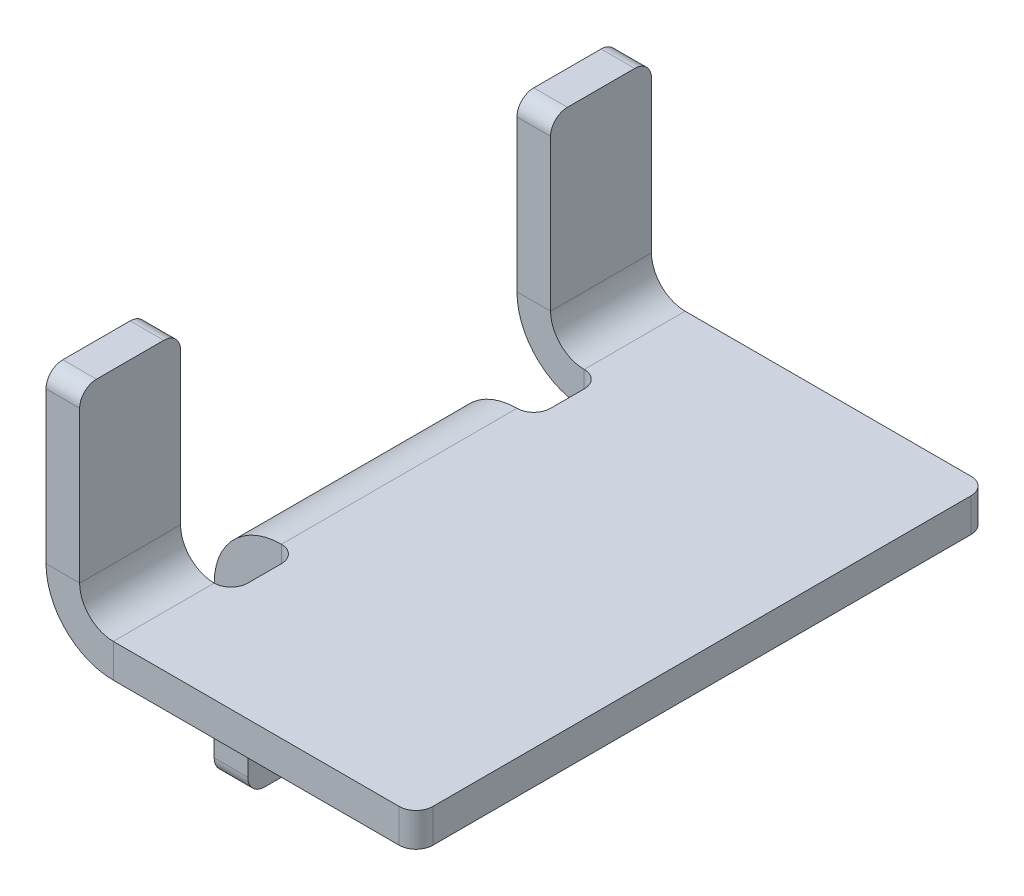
ISO-10303-21;
HEADER;
FILE_DESCRIPTION(('STEP AP214'),'2;1');
FILE_NAME('part.step','',(''),(''),'','','');
FILE_SCHEMA(('AUTOMOTIVE_DESIGN { 1 0 10303 214 1 1 1 1 }'));
ENDSEC;
DATA;
#1=APPLICATION_CONTEXT('core data for automotive mechanical design processes');
#2=APPLICATION_PROTOCOL_DEFINITION('international standard','automotive_design',2000,#1);
#3=PRODUCT_CONTEXT('',#1,'mechanical');
#4=PRODUCT('Part','Part','',(#3));
#5=PRODUCT_RELATED_PRODUCT_CATEGORY('part','',(#4));
#6=PRODUCT_DEFINITION_FORMATION('','',#4);
#7=PRODUCT_DEFINITION_CONTEXT('part definition',#1,'design');
#8=PRODUCT_DEFINITION('design','',#6,#7);
#9=PRODUCT_DEFINITION_SHAPE('','',#8);
#10=(LENGTH_UNIT() NAMED_UNIT(*) SI_UNIT(.MILLI.,.METRE.));
#11=(NAMED_UNIT(*) PLANE_ANGLE_UNIT() SI_UNIT($,.RADIAN.));
#12=(NAMED_UNIT(*) SI_UNIT($,.STERADIAN.) SOLID_ANGLE_UNIT());
#13=UNCERTAINTY_MEASURE_WITH_UNIT(LENGTH_MEASURE(1.E-05),#10,'distance_accuracy_value','');
#14=(GEOMETRIC_REPRESENTATION_CONTEXT(3) GLOBAL_UNCERTAINTY_ASSIGNED_CONTEXT((#13)) GLOBAL_UNIT_ASSIGNED_CONTEXT((#10,
#11,#12)) REPRESENTATION_CONTEXT('',''));
#15=CARTESIAN_POINT('',(0.,0.,0.));
#16=DIRECTION('',(0.,0.,1.));
#17=DIRECTION('',(1.,0.,0.));
#18=AXIS2_PLACEMENT_3D('',#15,#16,#17);
#19=CARTESIAN_POINT('',(1.,0.99999999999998,-8.50000000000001));
#20=DIRECTION('',(0.,0.,-1.));
#21=DIRECTION('',(-1.,0.,0.));
#22=AXIS2_PLACEMENT_3D('',#19,#20,#21);
#23=PLANE('',#22);
#24=DIRECTION('',(-1.,0.,0.));
#25=VECTOR('',#24,1.);
#26=CARTESIAN_POINT('',(0.,1.,-8.50000000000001));
#27=LINE('',#26,#25);
#28=CARTESIAN_POINT('',(0.,1.,-8.50000000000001));
#29=VERTEX_POINT('',#28);
#30=CARTESIAN_POINT('',(-1.,0.999999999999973,-8.50000000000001));
#31=VERTEX_POINT('',#30);
#32=EDGE_CURVE('E903',#29,#31,#27,.T.);
#33=ORIENTED_EDGE('',*,*,#32,.F.);
#34=CARTESIAN_POINT('',(1.,0.99999999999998,-8.50000000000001));
#35=DIRECTION('',(0.,0.,1.));
#36=DIRECTION('',(1.,0.,0.));
#37=AXIS2_PLACEMENT_3D('',#34,#35,#36);
#38=CIRCLE('',#37,1.);
#39=CARTESIAN_POINT('',(1.00000000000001,0.,-8.50000000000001));
#40=VERTEX_POINT('',#39);
#41=EDGE_CURVE('E259',#40,#29,#38,.F.);
#42=ORIENTED_EDGE('',*,*,#41,.F.);
#43=DIRECTION('',(0.,-1.,0.));
#44=VECTOR('',#43,1.);
#45=CARTESIAN_POINT('',(1.00000000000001,0.,-8.50000000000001));
#46=LINE('',#45,#44);
#47=CARTESIAN_POINT('',(0.999999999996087,-1.00000000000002,-8.50000000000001));
#48=VERTEX_POINT('',#47);
#49=EDGE_CURVE('E431',#40,#48,#46,.T.);
#50=ORIENTED_EDGE('',*,*,#49,.T.);
#51=CARTESIAN_POINT('',(1.,0.99999999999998,-8.50000000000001));
#52=DIRECTION('',(0.,0.,1.));
#53=DIRECTION('',(1.,0.,0.));
#54=AXIS2_PLACEMENT_3D('',#51,#52,#53);
#55=CIRCLE('',#54,2.);
#56=EDGE_CURVE('E428',#48,#31,#55,.F.);
#57=ORIENTED_EDGE('',*,*,#56,.T.);
#58=EDGE_LOOP('',(#33,#42,#50,#57));
#59=FACE_BOUND('',#58,.T.);
#60=ADVANCED_FACE('F35',(#59),#23,.T.);
#61=CARTESIAN_POINT('',(1.,0.99999999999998,-5.50000000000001));
#62=DIRECTION('',(0.,0.,-1.));
#63=DIRECTION('',(-1.,0.,0.));
#64=AXIS2_PLACEMENT_3D('',#61,#62,#63);
#65=PLANE('',#64);
#66=CARTESIAN_POINT('',(1.,0.99999999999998,-5.50000000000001));
#67=DIRECTION('',(0.,0.,1.));
#68=DIRECTION('',(1.,0.,0.));
#69=AXIS2_PLACEMENT_3D('',#66,#67,#68);
#70=CIRCLE('',#69,1.);
#71=CARTESIAN_POINT('',(0.,1.,-5.50000000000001));
#72=VERTEX_POINT('',#71);
#73=CARTESIAN_POINT('',(1.00000000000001,0.,-5.50000000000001));
#74=VERTEX_POINT('',#73);
#75=EDGE_CURVE('E265',#72,#74,#70,.T.);
#76=ORIENTED_EDGE('',*,*,#75,.F.);
#77=DIRECTION('',(-1.,0.,0.));
#78=VECTOR('',#77,1.);
#79=CARTESIAN_POINT('',(0.,1.,-5.50000000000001));
#80=LINE('',#79,#78);
#81=CARTESIAN_POINT('',(-1.,0.999999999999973,-5.49999999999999));
#82=VERTEX_POINT('',#81);
#83=EDGE_CURVE('E263',#72,#82,#80,.T.);
#84=ORIENTED_EDGE('',*,*,#83,.T.);
#85=CARTESIAN_POINT('',(1.,0.99999999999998,-5.50000000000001));
#86=DIRECTION('',(0.,0.,1.));
#87=DIRECTION('',(1.,0.,0.));
#88=AXIS2_PLACEMENT_3D('',#85,#86,#87);
#89=CIRCLE('',#88,2.);
#90=CARTESIAN_POINT('',(0.999999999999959,-1.00000000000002,-5.50000000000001));
#91=VERTEX_POINT('',#90);
#92=EDGE_CURVE('E248',#82,#91,#89,.T.);
#93=ORIENTED_EDGE('',*,*,#92,.T.);
#94=DIRECTION('',(0.,-1.,0.));
#95=VECTOR('',#94,1.);
#96=CARTESIAN_POINT('',(1.00000000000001,0.,-5.50000000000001));
#97=LINE('',#96,#95);
#98=EDGE_CURVE('E429',#74,#91,#97,.T.);
#99=ORIENTED_EDGE('',*,*,#98,.F.);
#100=EDGE_LOOP('',(#76,#84,#93,#99));
#101=FACE_BOUND('',#100,.T.);
#102=ADVANCED_FACE('F37',(#101),#65,.F.);
#103=CARTESIAN_POINT('',(1.,0.99999999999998,-5.50000000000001));
#104=DIRECTION('',(0.,0.,1.));
#105=DIRECTION('',(-1.,0.,0.));
#106=AXIS2_PLACEMENT_3D('',#103,#104,#105);
#107=CYLINDRICAL_SURFACE('',#106,2.);
#108=DIRECTION('',(0.,0.,1.));
#109=VECTOR('',#108,1.);
#110=CARTESIAN_POINT('',(0.999999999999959,-1.00000000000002,-5.50000000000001));
#111=LINE('',#110,#109);
#112=EDGE_CURVE('E255',#91,#48,#111,.F.);
#113=ORIENTED_EDGE('',*,*,#112,.F.);
#114=ORIENTED_EDGE('',*,*,#92,.F.);
#115=DIRECTION('',(0.,0.,-1.));
#116=VECTOR('',#115,1.);
#117=CARTESIAN_POINT('',(-1.,0.999999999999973,-5.49999999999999));
#118=LINE('',#117,#116);
#119=EDGE_CURVE('E252',#82,#31,#118,.T.);
#120=ORIENTED_EDGE('',*,*,#119,.T.);
#121=ORIENTED_EDGE('',*,*,#56,.F.);
#122=EDGE_LOOP('',(#113,#114,#120,#121));
#123=FACE_BOUND('',#122,.T.);
#124=ADVANCED_FACE('F250',(#123),#107,.T.);
#125=CARTESIAN_POINT('',(1.,0.99999999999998,-5.50000000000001));
#126=DIRECTION('',(0.,0.,1.));
#127=DIRECTION('',(-1.,0.,0.));
#128=AXIS2_PLACEMENT_3D('',#125,#126,#127);
#129=CYLINDRICAL_SURFACE('',#128,1.);
#130=DIRECTION('',(0.,0.,1.));
#131=VECTOR('',#130,1.);
#132=CARTESIAN_POINT('',(1.00000000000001,0.,-5.50000000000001));
#133=LINE('',#132,#131);
#134=EDGE_CURVE('E424',#74,#40,#133,.F.);
#135=ORIENTED_EDGE('',*,*,#134,.T.);
#136=ORIENTED_EDGE('',*,*,#41,.T.);
#137=DIRECTION('',(0.,0.,1.));
#138=VECTOR('',#137,1.);
#139=CARTESIAN_POINT('',(0.,1.,-8.50000000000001));
#140=LINE('',#139,#138);
#141=EDGE_CURVE('E270',#29,#72,#140,.T.);
#142=ORIENTED_EDGE('',*,*,#141,.T.);
#143=ORIENTED_EDGE('',*,*,#75,.T.);
#144=EDGE_LOOP('',(#135,#136,#142,#143));
#145=FACE_BOUND('',#144,.T.);
#146=ADVANCED_FACE('F603',(#145),#129,.F.);
#147=CARTESIAN_POINT('',(0.,-1.,8.50000000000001));
#148=DIRECTION('',(0.,1.,0.));
#149=DIRECTION('',(0.,0.,1.));
#150=AXIS2_PLACEMENT_3D('',#147,#148,#149);
#151=PLANE('',#150);
#152=DIRECTION('',(0.,0.,-1.));
#153=VECTOR('',#152,1.);
#154=CARTESIAN_POINT('',(9.99999999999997,-1.,8.49999999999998));
#155=LINE('',#154,#153);
#156=CARTESIAN_POINT('',(9.99999999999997,-1.,7.99999999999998));
#157=VERTEX_POINT('',#156);
#158=CARTESIAN_POINT('',(9.99999999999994,-1.,-8.00000000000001));
#159=VERTEX_POINT('',#158);
#160=EDGE_CURVE('E371',#157,#159,#155,.T.);
#161=ORIENTED_EDGE('',*,*,#160,.F.);
#162=CARTESIAN_POINT('',(9.49999999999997,-1.00000000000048,7.99999999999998));
#163=DIRECTION('',(0.,1.,0.));
#164=DIRECTION('',(0.,0.,1.));
#165=AXIS2_PLACEMENT_3D('',#162,#163,#164);
#166=CIRCLE('',#165,0.5);
#167=CARTESIAN_POINT('',(9.49999999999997,-1.00000000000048,8.49999999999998));
#168=VERTEX_POINT('',#167);
#169=EDGE_CURVE('E470',#157,#168,#166,.F.);
#170=ORIENTED_EDGE('',*,*,#169,.T.);
#171=DIRECTION('',(1.,0.,0.));
#172=VECTOR('',#171,1.);
#173=CARTESIAN_POINT('',(0.,-1.,8.50000000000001));
#174=LINE('',#173,#172);
#175=CARTESIAN_POINT('',(0.999999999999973,-1.00000000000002,8.50000000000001));
#176=VERTEX_POINT('',#175);
#177=EDGE_CURVE('E362',#176,#168,#174,.T.);
#178=ORIENTED_EDGE('',*,*,#177,.F.);
#179=DIRECTION('',(0.,0.,1.));
#180=VECTOR('',#179,1.);
#181=CARTESIAN_POINT('',(0.999999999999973,-1.00000000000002,8.50000000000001));
#182=LINE('',#181,#180);
#183=CARTESIAN_POINT('',(1.,-1.00000000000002,5.49999999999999));
#184=VERTEX_POINT('',#183);
#185=EDGE_CURVE('E384',#176,#184,#182,.F.);
#186=ORIENTED_EDGE('',*,*,#185,.T.);
#187=CARTESIAN_POINT('',(1.,-1.00000000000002,4.99999999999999));
#188=DIRECTION('',(0.,1.,0.));
#189=DIRECTION('',(0.,0.,1.));
#190=AXIS2_PLACEMENT_3D('',#187,#188,#189);
#191=CIRCLE('',#190,0.5);
#192=CARTESIAN_POINT('',(1.5,-1.,4.99999999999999));
#193=VERTEX_POINT('',#192);
#194=EDGE_CURVE('E516',#184,#193,#191,.T.);
#195=ORIENTED_EDGE('',*,*,#194,.T.);
#196=DIRECTION('',(0.,0.,1.));
#197=VECTOR('',#196,1.);
#198=CARTESIAN_POINT('',(1.5,-1.,3.49999999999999));
#199=LINE('',#198,#197);
#200=CARTESIAN_POINT('',(1.5,-1.,3.99999999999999));
#201=VERTEX_POINT('',#200);
#202=EDGE_CURVE('E353',#201,#193,#199,.T.);
#203=ORIENTED_EDGE('',*,*,#202,.F.);
#204=CARTESIAN_POINT('',(1.,-1.00000000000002,3.99999999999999));
#205=DIRECTION('',(0.,1.,0.));
#206=DIRECTION('',(0.,0.,1.));
#207=AXIS2_PLACEMENT_3D('',#204,#205,#206);
#208=CIRCLE('',#207,0.5);
#209=CARTESIAN_POINT('',(1.,-1.00000000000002,3.5));
#210=VERTEX_POINT('',#209);
#211=EDGE_CURVE('E520',#201,#210,#208,.T.);
#212=ORIENTED_EDGE('',*,*,#211,.T.);
#213=DIRECTION('',(0.,0.,-1.));
#214=VECTOR('',#213,1.);
#215=CARTESIAN_POINT('',(1.00000000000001,-1.00000000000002,-3.5));
#216=LINE('',#215,#214);
#217=CARTESIAN_POINT('',(1.00000000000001,-1.00000000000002,-3.5));
#218=VERTEX_POINT('',#217);
#219=EDGE_CURVE('E403',#218,#210,#216,.F.);
#220=ORIENTED_EDGE('',*,*,#219,.F.);
#221=CARTESIAN_POINT('',(1.00000000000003,-1.00000000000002,-4.));
#222=DIRECTION('',(0.,1.,0.));
#223=DIRECTION('',(0.,0.,1.));
#224=AXIS2_PLACEMENT_3D('',#221,#222,#223);
#225=CIRCLE('',#224,0.5);
#226=CARTESIAN_POINT('',(1.50000000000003,-1.,-4.));
#227=VERTEX_POINT('',#226);
#228=EDGE_CURVE('E524',#218,#227,#225,.T.);
#229=ORIENTED_EDGE('',*,*,#228,.T.);
#230=DIRECTION('',(0.,0.,-1.));
#231=VECTOR('',#230,1.);
#232=CARTESIAN_POINT('',(1.50000000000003,-1.,-3.5));
#233=LINE('',#232,#231);
#234=CARTESIAN_POINT('',(1.50000000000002,-1.,-5.));
#235=VERTEX_POINT('',#234);
#236=EDGE_CURVE('E347',#227,#235,#233,.T.);
#237=ORIENTED_EDGE('',*,*,#236,.T.);
#238=CARTESIAN_POINT('',(1.00000000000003,-1.00000000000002,-5.));
#239=DIRECTION('',(0.,1.,0.));
#240=DIRECTION('',(0.,0.,1.));
#241=AXIS2_PLACEMENT_3D('',#238,#239,#240);
#242=CIRCLE('',#241,0.5);
#243=EDGE_CURVE('E11',#235,#91,#242,.T.);
#244=ORIENTED_EDGE('',*,*,#243,.T.);
#245=ORIENTED_EDGE('',*,*,#112,.T.);
#246=DIRECTION('',(1.,0.,0.));
#247=VECTOR('',#246,1.);
#248=CARTESIAN_POINT('',(-3.91353616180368E-12,-1.,-8.50000000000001));
#249=LINE('',#248,#247);
#250=CARTESIAN_POINT('',(9.4999999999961,-1.00000000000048,-8.50000000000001));
#251=VERTEX_POINT('',#250);
#252=EDGE_CURVE('E356',#48,#251,#249,.T.);
#253=ORIENTED_EDGE('',*,*,#252,.T.);
#254=CARTESIAN_POINT('',(9.49999999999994,-1.00000000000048,-8.00000000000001));
#255=DIRECTION('',(0.,1.,0.));
#256=DIRECTION('',(0.,0.,1.));
#257=AXIS2_PLACEMENT_3D('',#254,#255,#256);
#258=CIRCLE('',#257,0.5);
#259=EDGE_CURVE('E468',#251,#159,#258,.F.);
#260=ORIENTED_EDGE('',*,*,#259,.T.);
#261=EDGE_LOOP('',(#161,#170,#178,#186,#195,#203,#212,#220,#229,#237,#244,#245,#253,#260));
#262=FACE_BOUND('',#261,.T.);
#263=ADVANCED_FACE('F540',(#262),#151,.F.);
#264=CARTESIAN_POINT('',(-3.70536934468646E-12,0.,8.50000000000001));
#265=DIRECTION('',(0.,1.,0.));
#266=DIRECTION('',(0.,0.,1.));
#267=AXIS2_PLACEMENT_3D('',#264,#265,#266);
#268=PLANE('',#267);
#269=DIRECTION('',(1.,0.,0.));
#270=VECTOR('',#269,1.);
#271=CARTESIAN_POINT('',(-3.70536934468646E-12,0.,8.50000000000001));
#272=LINE('',#271,#270);
#273=CARTESIAN_POINT('',(0.999999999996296,0.,8.50000000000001));
#274=VERTEX_POINT('',#273);
#275=CARTESIAN_POINT('',(9.4999999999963,-4.85722573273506E-13,8.49999999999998));
#276=VERTEX_POINT('',#275);
#277=EDGE_CURVE('E365',#274,#276,#272,.T.);
#278=ORIENTED_EDGE('',*,*,#277,.T.);
#279=CARTESIAN_POINT('',(9.49999999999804,-4.85722573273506E-13,7.99999999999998));
#280=DIRECTION('',(0.,1.,0.));
#281=DIRECTION('',(0.,0.,1.));
#282=AXIS2_PLACEMENT_3D('',#279,#280,#281);
#283=CIRCLE('',#282,0.5);
#284=CARTESIAN_POINT('',(9.99999999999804,0.,7.99999999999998));
#285=VERTEX_POINT('',#284);
#286=EDGE_CURVE('E476',#276,#285,#283,.T.);
#287=ORIENTED_EDGE('',*,*,#286,.T.);
#288=DIRECTION('',(0.,0.,-1.));
#289=VECTOR('',#288,1.);
#290=CARTESIAN_POINT('',(9.9999999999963,0.,8.49999999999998));
#291=LINE('',#290,#289);
#292=CARTESIAN_POINT('',(10.,0.,-8.00000000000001));
#293=VERTEX_POINT('',#292);
#294=EDGE_CURVE('E368',#285,#293,#291,.T.);
#295=ORIENTED_EDGE('',*,*,#294,.T.);
#296=CARTESIAN_POINT('',(9.50000000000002,-4.85722573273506E-13,-8.00000000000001));
#297=DIRECTION('',(0.,1.,0.));
#298=DIRECTION('',(0.,0.,1.));
#299=AXIS2_PLACEMENT_3D('',#296,#297,#298);
#300=CIRCLE('',#299,0.5);
#301=CARTESIAN_POINT('',(9.50000000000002,-4.85722573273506E-13,-8.50000000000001));
#302=VERTEX_POINT('',#301);
#303=EDGE_CURVE('E474',#293,#302,#300,.T.);
#304=ORIENTED_EDGE('',*,*,#303,.T.);
#305=DIRECTION('',(1.,0.,0.));
#306=VECTOR('',#305,1.);
#307=CARTESIAN_POINT('',(0.,0.,-8.50000000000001));
#308=LINE('',#307,#306);
#309=EDGE_CURVE('E359',#40,#302,#308,.T.);
#310=ORIENTED_EDGE('',*,*,#309,.F.);
#311=ORIENTED_EDGE('',*,*,#134,.F.);
#312=CARTESIAN_POINT('',(1.00000000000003,0.,-5.));
#313=DIRECTION('',(0.,1.,0.));
#314=DIRECTION('',(0.,0.,1.));
#315=AXIS2_PLACEMENT_3D('',#312,#313,#314);
#316=CIRCLE('',#315,0.5);
#317=CARTESIAN_POINT('',(1.50000000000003,-4.85722573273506E-13,-5.));
#318=VERTEX_POINT('',#317);
#319=EDGE_CURVE('E43',#74,#318,#316,.F.);
#320=ORIENTED_EDGE('',*,*,#319,.T.);
#321=DIRECTION('',(0.,0.,-1.));
#322=VECTOR('',#321,1.);
#323=CARTESIAN_POINT('',(1.5,-4.85722573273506E-13,-3.5));
#324=LINE('',#323,#322);
#325=CARTESIAN_POINT('',(1.50000000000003,-4.85722573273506E-13,-4.));
#326=VERTEX_POINT('',#325);
#327=EDGE_CURVE('E344',#326,#318,#324,.T.);
#328=ORIENTED_EDGE('',*,*,#327,.F.);
#329=CARTESIAN_POINT('',(1.00000000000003,0.,-4.));
#330=DIRECTION('',(0.,1.,0.));
#331=DIRECTION('',(0.,0.,1.));
#332=AXIS2_PLACEMENT_3D('',#329,#330,#331);
#333=CIRCLE('',#332,0.5);
#334=CARTESIAN_POINT('',(1.,0.,-3.5));
#335=VERTEX_POINT('',#334);
#336=EDGE_CURVE('E522',#326,#335,#333,.F.);
#337=ORIENTED_EDGE('',*,*,#336,.T.);
#338=DIRECTION('',(0.,0.,-1.));
#339=VECTOR('',#338,1.);
#340=CARTESIAN_POINT('',(1.,0.,-3.5));
#341=LINE('',#340,#339);
#342=CARTESIAN_POINT('',(0.99999999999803,0.,3.5));
#343=VERTEX_POINT('',#342);
#344=EDGE_CURVE('E408',#335,#343,#341,.F.);
#345=ORIENTED_EDGE('',*,*,#344,.T.);
#346=CARTESIAN_POINT('',(0.99999999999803,0.,3.99999999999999));
#347=DIRECTION('',(0.,1.,0.));
#348=DIRECTION('',(0.,0.,1.));
#349=AXIS2_PLACEMENT_3D('',#346,#347,#348);
#350=CIRCLE('',#349,0.5);
#351=CARTESIAN_POINT('',(1.49999999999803,-4.85722573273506E-13,3.99999999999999));
#352=VERTEX_POINT('',#351);
#353=EDGE_CURVE('E518',#343,#352,#350,.F.);
#354=ORIENTED_EDGE('',*,*,#353,.T.);
#355=DIRECTION('',(0.,0.,1.));
#356=VECTOR('',#355,1.);
#357=CARTESIAN_POINT('',(1.49999999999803,-4.85722573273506E-13,3.49999999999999));
#358=LINE('',#357,#356);
#359=CARTESIAN_POINT('',(1.49999999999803,-4.85722573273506E-13,4.99999999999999));
#360=VERTEX_POINT('',#359);
#361=EDGE_CURVE('E350',#352,#360,#358,.T.);
#362=ORIENTED_EDGE('',*,*,#361,.T.);
#363=CARTESIAN_POINT('',(0.99999999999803,0.,4.99999999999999));
#364=DIRECTION('',(0.,1.,0.));
#365=DIRECTION('',(0.,0.,1.));
#366=AXIS2_PLACEMENT_3D('',#363,#364,#365);
#367=CIRCLE('',#366,0.5);
#368=CARTESIAN_POINT('',(0.99999999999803,0.,5.49999999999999));
#369=VERTEX_POINT('',#368);
#370=EDGE_CURVE('E514',#360,#369,#367,.F.);
#371=ORIENTED_EDGE('',*,*,#370,.T.);
#372=DIRECTION('',(0.,0.,1.));
#373=VECTOR('',#372,1.);
#374=CARTESIAN_POINT('',(0.999999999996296,0.,8.50000000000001));
#375=LINE('',#374,#373);
#376=EDGE_CURVE('E379',#274,#369,#375,.F.);
#377=ORIENTED_EDGE('',*,*,#376,.F.);
#378=EDGE_LOOP('',(#278,#287,#295,#304,#310,#311,#320,#328,#337,#345,#354,#362,#371,#377));
#379=FACE_BOUND('',#378,.T.);
#380=ADVANCED_FACE('F528',(#379),#268,.T.);
#381=CARTESIAN_POINT('',(1.00000000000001,-2.00000000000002,3.5));
#382=DIRECTION('',(0.,0.,1.));
#383=DIRECTION('',(1.,0.,0.));
#384=AXIS2_PLACEMENT_3D('',#381,#382,#383);
#385=PLANE('',#384);
#386=DIRECTION('',(-1.,0.,0.));
#387=VECTOR('',#386,1.);
#388=CARTESIAN_POINT('',(0.,-1.99999999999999,3.5));
#389=LINE('',#388,#387);
#390=CARTESIAN_POINT('',(0.,-1.99999999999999,3.5));
#391=VERTEX_POINT('',#390);
#392=CARTESIAN_POINT('',(-0.999999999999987,-2.00000000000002,3.5));
#393=VERTEX_POINT('',#392);
#394=EDGE_CURVE('E294',#391,#393,#389,.T.);
#395=ORIENTED_EDGE('',*,*,#394,.F.);
#396=CARTESIAN_POINT('',(1.00000000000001,-2.00000000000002,3.5));
#397=DIRECTION('',(0.,0.,-1.));
#398=DIRECTION('',(-1.,0.,0.));
#399=AXIS2_PLACEMENT_3D('',#396,#397,#398);
#400=CIRCLE('',#399,1.);
#401=EDGE_CURVE('E399',#210,#391,#400,.F.);
#402=ORIENTED_EDGE('',*,*,#401,.F.);
#403=DIRECTION('',(0.,1.,0.));
#404=VECTOR('',#403,1.);
#405=CARTESIAN_POINT('',(1.,-1.00000000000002,3.5));
#406=LINE('',#405,#404);
#407=EDGE_CURVE('E417',#210,#343,#406,.T.);
#408=ORIENTED_EDGE('',*,*,#407,.T.);
#409=CARTESIAN_POINT('',(1.00000000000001,-2.00000000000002,3.5));
#410=DIRECTION('',(0.,0.,-1.));
#411=DIRECTION('',(-1.,0.,0.));
#412=AXIS2_PLACEMENT_3D('',#409,#410,#411);
#413=CIRCLE('',#412,2.);
#414=EDGE_CURVE('E411',#343,#393,#413,.F.);
#415=ORIENTED_EDGE('',*,*,#414,.T.);
#416=EDGE_LOOP('',(#395,#402,#408,#415));
#417=FACE_BOUND('',#416,.T.);
#418=ADVANCED_FACE('F582',(#417),#385,.T.);
#419=CARTESIAN_POINT('',(0.999999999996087,-2.00000000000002,-3.5));
#420=DIRECTION('',(0.,0.,1.));
#421=DIRECTION('',(1.,0.,0.));
#422=AXIS2_PLACEMENT_3D('',#419,#420,#421);
#423=PLANE('',#422);
#424=CARTESIAN_POINT('',(0.999999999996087,-2.00000000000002,-3.5));
#425=DIRECTION('',(0.,0.,-1.));
#426=DIRECTION('',(-1.,0.,0.));
#427=AXIS2_PLACEMENT_3D('',#424,#425,#426);
#428=CIRCLE('',#427,1.);
#429=CARTESIAN_POINT('',(-3.91353616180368E-12,-1.99999999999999,-3.5));
#430=VERTEX_POINT('',#429);
#431=EDGE_CURVE('E396',#430,#218,#428,.T.);
#432=ORIENTED_EDGE('',*,*,#431,.F.);
#433=DIRECTION('',(-1.,0.,0.));
#434=VECTOR('',#433,1.);
#435=CARTESIAN_POINT('',(-3.91353616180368E-12,-1.99999999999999,-3.5));
#436=LINE('',#435,#434);
#437=CARTESIAN_POINT('',(-1.00000000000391,-2.00000000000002,-3.5));
#438=VERTEX_POINT('',#437);
#439=EDGE_CURVE('E297',#430,#438,#436,.T.);
#440=ORIENTED_EDGE('',*,*,#439,.T.);
#441=CARTESIAN_POINT('',(0.999999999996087,-2.00000000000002,-3.5));
#442=DIRECTION('',(0.,0.,-1.));
#443=DIRECTION('',(-1.,0.,0.));
#444=AXIS2_PLACEMENT_3D('',#441,#442,#443);
#445=CIRCLE('',#444,2.);
#446=EDGE_CURVE('E402',#438,#335,#445,.T.);
#447=ORIENTED_EDGE('',*,*,#446,.T.);
#448=DIRECTION('',(0.,1.,0.));
#449=VECTOR('',#448,1.);
#450=CARTESIAN_POINT('',(1.00000000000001,-1.00000000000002,-3.5));
#451=LINE('',#450,#449);
#452=EDGE_CURVE('E414',#218,#335,#451,.T.);
#453=ORIENTED_EDGE('',*,*,#452,.F.);
#454=EDGE_LOOP('',(#432,#440,#447,#453));
#455=FACE_BOUND('',#454,.T.);
#456=ADVANCED_FACE('F552',(#455),#423,.F.);
#457=CARTESIAN_POINT('',(0.999999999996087,-2.00000000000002,-3.5));
#458=DIRECTION('',(0.,0.,-1.));
#459=DIRECTION('',(-1.,0.,0.));
#460=AXIS2_PLACEMENT_3D('',#457,#458,#459);
#461=CYLINDRICAL_SURFACE('',#460,2.);
#462=ORIENTED_EDGE('',*,*,#344,.F.);
#463=ORIENTED_EDGE('',*,*,#446,.F.);
#464=DIRECTION('',(0.,0.,1.));
#465=VECTOR('',#464,1.);
#466=CARTESIAN_POINT('',(-1.00000000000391,-2.00000000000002,-3.5));
#467=LINE('',#466,#465);
#468=EDGE_CURVE('E300',#438,#393,#467,.T.);
#469=ORIENTED_EDGE('',*,*,#468,.T.);
#470=ORIENTED_EDGE('',*,*,#414,.F.);
#471=EDGE_LOOP('',(#462,#463,#469,#470));
#472=FACE_BOUND('',#471,.T.);
#473=ADVANCED_FACE('F549',(#472),#461,.T.);
#474=CARTESIAN_POINT('',(0.999999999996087,-2.00000000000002,-3.5));
#475=DIRECTION('',(0.,0.,-1.));
#476=DIRECTION('',(-1.,0.,0.));
#477=AXIS2_PLACEMENT_3D('',#474,#475,#476);
#478=CYLINDRICAL_SURFACE('',#477,1.);
#479=ORIENTED_EDGE('',*,*,#219,.T.);
#480=ORIENTED_EDGE('',*,*,#401,.T.);
#481=DIRECTION('',(0.,0.,-1.));
#482=VECTOR('',#481,1.);
#483=CARTESIAN_POINT('',(0.,-1.99999999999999,3.5));
#484=LINE('',#483,#482);
#485=EDGE_CURVE('E295',#391,#430,#484,.T.);
#486=ORIENTED_EDGE('',*,*,#485,.T.);
#487=ORIENTED_EDGE('',*,*,#431,.T.);
#488=EDGE_LOOP('',(#479,#480,#486,#487));
#489=FACE_BOUND('',#488,.T.);
#490=ADVANCED_FACE('F586',(#489),#478,.F.);
#491=CARTESIAN_POINT('',(0.999999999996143,0.99999999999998,5.49999999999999));
#492=DIRECTION('',(0.,0.,-1.));
#493=DIRECTION('',(-1.,0.,0.));
#494=AXIS2_PLACEMENT_3D('',#491,#492,#493);
#495=PLANE('',#494);
#496=DIRECTION('',(-1.,0.,0.));
#497=VECTOR('',#496,1.);
#498=CARTESIAN_POINT('',(-3.85802501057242E-12,1.,5.50000000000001));
#499=LINE('',#498,#497);
#500=CARTESIAN_POINT('',(-3.85802501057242E-12,1.,5.50000000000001));
#501=VERTEX_POINT('',#500);
#502=CARTESIAN_POINT('',(-1.00000000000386,0.999999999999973,5.50000000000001));
#503=VERTEX_POINT('',#502);
#504=EDGE_CURVE('E321',#501,#503,#499,.T.);
#505=ORIENTED_EDGE('',*,*,#504,.F.);
#506=CARTESIAN_POINT('',(0.999999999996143,0.99999999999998,5.49999999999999));
#507=DIRECTION('',(0.,0.,1.));
#508=DIRECTION('',(1.,0.,0.));
#509=AXIS2_PLACEMENT_3D('',#506,#507,#508);
#510=CIRCLE('',#509,1.);
#511=EDGE_CURVE('E375',#369,#501,#510,.F.);
#512=ORIENTED_EDGE('',*,*,#511,.F.);
#513=DIRECTION('',(0.,-1.,0.));
#514=VECTOR('',#513,1.);
#515=CARTESIAN_POINT('',(0.99999999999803,0.,5.49999999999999));
#516=LINE('',#515,#514);
#517=EDGE_CURVE('E393',#369,#184,#516,.T.);
#518=ORIENTED_EDGE('',*,*,#517,.T.);
#519=CARTESIAN_POINT('',(0.999999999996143,0.99999999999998,5.49999999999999));
#520=DIRECTION('',(0.,0.,1.));
#521=DIRECTION('',(1.,0.,0.));
#522=AXIS2_PLACEMENT_3D('',#519,#520,#521);
#523=CIRCLE('',#522,2.);
#524=EDGE_CURVE('E387',#184,#503,#523,.F.);
#525=ORIENTED_EDGE('',*,*,#524,.T.);
#526=EDGE_LOOP('',(#505,#512,#518,#525));
#527=FACE_BOUND('',#526,.T.);
#528=ADVANCED_FACE('F621',(#527),#495,.T.);
#529=CARTESIAN_POINT('',(1.00000000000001,0.99999999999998,8.50000000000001));
#530=DIRECTION('',(0.,0.,-1.));
#531=DIRECTION('',(-1.,0.,0.));
#532=AXIS2_PLACEMENT_3D('',#529,#530,#531);
#533=PLANE('',#532);
#534=CARTESIAN_POINT('',(1.00000000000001,0.99999999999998,8.50000000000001));
#535=DIRECTION('',(0.,0.,1.));
#536=DIRECTION('',(1.,0.,0.));
#537=AXIS2_PLACEMENT_3D('',#534,#535,#536);
#538=CIRCLE('',#537,1.);
#539=CARTESIAN_POINT('',(0.,1.,8.50000000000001));
#540=VERTEX_POINT('',#539);
#541=EDGE_CURVE('E374',#540,#274,#538,.T.);
#542=ORIENTED_EDGE('',*,*,#541,.F.);
#543=DIRECTION('',(-1.,0.,0.));
#544=VECTOR('',#543,1.);
#545=CARTESIAN_POINT('',(0.,1.,8.50000000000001));
#546=LINE('',#545,#544);
#547=CARTESIAN_POINT('',(-0.999999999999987,0.999999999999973,8.50000000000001));
#548=VERTEX_POINT('',#547);
#549=EDGE_CURVE('E324',#540,#548,#546,.T.);
#550=ORIENTED_EDGE('',*,*,#549,.T.);
#551=CARTESIAN_POINT('',(1.00000000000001,0.99999999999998,8.50000000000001));
#552=DIRECTION('',(0.,0.,1.));
#553=DIRECTION('',(1.,0.,0.));
#554=AXIS2_PLACEMENT_3D('',#551,#552,#553);
#555=CIRCLE('',#554,2.);
#556=EDGE_CURVE('E378',#548,#176,#555,.T.);
#557=ORIENTED_EDGE('',*,*,#556,.T.);
#558=DIRECTION('',(0.,-1.,0.));
#559=VECTOR('',#558,1.);
#560=CARTESIAN_POINT('',(0.999999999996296,0.,8.50000000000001));
#561=LINE('',#560,#559);
#562=EDGE_CURVE('E390',#274,#176,#561,.T.);
#563=ORIENTED_EDGE('',*,*,#562,.F.);
#564=EDGE_LOOP('',(#542,#550,#557,#563));
#565=FACE_BOUND('',#564,.T.);
#566=ADVANCED_FACE('F622',(#565),#533,.F.);
#567=CARTESIAN_POINT('',(1.00000000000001,0.99999999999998,8.50000000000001));
#568=DIRECTION('',(0.,0.,1.));
#569=DIRECTION('',(-1.,0.,0.));
#570=AXIS2_PLACEMENT_3D('',#567,#568,#569);
#571=CYLINDRICAL_SURFACE('',#570,2.);
#572=ORIENTED_EDGE('',*,*,#185,.F.);
#573=ORIENTED_EDGE('',*,*,#556,.F.);
#574=DIRECTION('',(0.,0.,-1.));
#575=VECTOR('',#574,1.);
#576=CARTESIAN_POINT('',(-1.00000000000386,0.999999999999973,5.50000000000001));
#577=LINE('',#576,#575);
#578=EDGE_CURVE('E327',#548,#503,#577,.T.);
#579=ORIENTED_EDGE('',*,*,#578,.T.);
#580=ORIENTED_EDGE('',*,*,#524,.F.);
#581=EDGE_LOOP('',(#572,#573,#579,#580));
#582=FACE_BOUND('',#581,.T.);
#583=ADVANCED_FACE('F625',(#582),#571,.T.);
#584=CARTESIAN_POINT('',(1.00000000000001,0.99999999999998,8.50000000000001));
#585=DIRECTION('',(0.,0.,1.));
#586=DIRECTION('',(-1.,0.,0.));
#587=AXIS2_PLACEMENT_3D('',#584,#585,#586);
#588=CYLINDRICAL_SURFACE('',#587,1.);
#589=ORIENTED_EDGE('',*,*,#376,.T.);
#590=ORIENTED_EDGE('',*,*,#511,.T.);
#591=DIRECTION('',(0.,0.,1.));
#592=VECTOR('',#591,1.);
#593=CARTESIAN_POINT('',(-3.85802501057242E-12,1.,5.50000000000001));
#594=LINE('',#593,#592);
#595=EDGE_CURVE('E322',#501,#540,#594,.T.);
#596=ORIENTED_EDGE('',*,*,#595,.T.);
#597=ORIENTED_EDGE('',*,*,#541,.T.);
#598=EDGE_LOOP('',(#589,#590,#596,#597));
#599=FACE_BOUND('',#598,.T.);
#600=ADVANCED_FACE('F627',(#599),#588,.F.);
#601=CARTESIAN_POINT('',(9.99999999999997,-1.,8.49999999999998));
#602=DIRECTION('',(0.,0.,-1.));
#603=DIRECTION('',(-1.,0.,0.));
#604=AXIS2_PLACEMENT_3D('',#601,#602,#603);
#605=PLANE('',#604);
#606=ORIENTED_EDGE('',*,*,#177,.T.);
#607=DIRECTION('',(0.,-1.,0.));
#608=VECTOR('',#607,1.);
#609=CARTESIAN_POINT('',(9.4999999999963,-4.85722573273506E-13,8.49999999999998));
#610=LINE('',#609,#608);
#611=EDGE_CURVE('E472',#168,#276,#610,.F.);
#612=ORIENTED_EDGE('',*,*,#611,.T.);
#613=ORIENTED_EDGE('',*,*,#277,.F.);
#614=ORIENTED_EDGE('',*,*,#562,.T.);
#615=EDGE_LOOP('',(#606,#612,#613,#614));
#616=FACE_BOUND('',#615,.T.);
#617=ADVANCED_FACE('F636',(#616),#605,.F.);
#618=CARTESIAN_POINT('',(9.9999999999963,0.,8.49999999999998));
#619=DIRECTION('',(1.,0.,0.));
#620=DIRECTION('',(0.,0.,-1.));
#621=AXIS2_PLACEMENT_3D('',#618,#619,#620);
#622=PLANE('',#621);
#623=ORIENTED_EDGE('',*,*,#294,.F.);
#624=DIRECTION('',(0.,-1.,0.));
#625=VECTOR('',#624,1.);
#626=CARTESIAN_POINT('',(9.99999999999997,-1.,7.99999999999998));
#627=LINE('',#626,#625);
#628=EDGE_CURVE('E465',#285,#157,#627,.T.);
#629=ORIENTED_EDGE('',*,*,#628,.T.);
#630=ORIENTED_EDGE('',*,*,#160,.T.);
#631=DIRECTION('',(0.,-1.,0.));
#632=VECTOR('',#631,1.);
#633=CARTESIAN_POINT('',(10.,0.,-8.00000000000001));
#634=LINE('',#633,#632);
#635=EDGE_CURVE('E463',#159,#293,#634,.F.);
#636=ORIENTED_EDGE('',*,*,#635,.T.);
#637=EDGE_LOOP('',(#623,#629,#630,#636));
#638=FACE_BOUND('',#637,.T.);
#639=ADVANCED_FACE('F640',(#638),#622,.T.);
#640=CARTESIAN_POINT('',(9.9999999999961,-1.,-8.50000000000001));
#641=DIRECTION('',(0.,0.,-1.));
#642=DIRECTION('',(-1.,0.,0.));
#643=AXIS2_PLACEMENT_3D('',#640,#641,#642);
#644=PLANE('',#643);
#645=ORIENTED_EDGE('',*,*,#309,.T.);
#646=DIRECTION('',(0.,-1.,0.));
#647=VECTOR('',#646,1.);
#648=CARTESIAN_POINT('',(9.4999999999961,-1.00000000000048,-8.50000000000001));
#649=LINE('',#648,#647);
#650=EDGE_CURVE('E478',#302,#251,#649,.T.);
#651=ORIENTED_EDGE('',*,*,#650,.T.);
#652=ORIENTED_EDGE('',*,*,#252,.F.);
#653=ORIENTED_EDGE('',*,*,#49,.F.);
#654=EDGE_LOOP('',(#645,#651,#652,#653));
#655=FACE_BOUND('',#654,.T.);
#656=ADVANCED_FACE('F643',(#655),#644,.T.);
#657=CARTESIAN_POINT('',(1.5,-1.,3.49999999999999));
#658=DIRECTION('',(-1.,0.,0.));
#659=DIRECTION('',(0.,0.,1.));
#660=AXIS2_PLACEMENT_3D('',#657,#658,#659);
#661=PLANE('',#660);
#662=ORIENTED_EDGE('',*,*,#202,.T.);
#663=DIRECTION('',(0.,1.,0.));
#664=VECTOR('',#663,1.);
#665=CARTESIAN_POINT('',(1.5,-1.,4.99999999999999));
#666=LINE('',#665,#664);
#667=EDGE_CURVE('E455',#193,#360,#666,.T.);
#668=ORIENTED_EDGE('',*,*,#667,.T.);
#669=ORIENTED_EDGE('',*,*,#361,.F.);
#670=DIRECTION('',(0.,1.,0.));
#671=VECTOR('',#670,1.);
#672=CARTESIAN_POINT('',(1.5,-1.,3.99999999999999));
#673=LINE('',#672,#671);
#674=EDGE_CURVE('E453',#352,#201,#673,.F.);
#675=ORIENTED_EDGE('',*,*,#674,.T.);
#676=EDGE_LOOP('',(#662,#668,#669,#675));
#677=FACE_BOUND('',#676,.T.);
#678=ADVANCED_FACE('F652',(#677),#661,.T.);
#679=CARTESIAN_POINT('',(1.50000000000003,-1.,-3.5));
#680=DIRECTION('',(1.,0.,0.));
#681=DIRECTION('',(0.,0.,-1.));
#682=AXIS2_PLACEMENT_3D('',#679,#680,#681);
#683=PLANE('',#682);
#684=ORIENTED_EDGE('',*,*,#236,.F.);
#685=DIRECTION('',(0.,1.,0.));
#686=VECTOR('',#685,1.);
#687=CARTESIAN_POINT('',(1.50000000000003,-4.85722573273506E-13,-4.));
#688=LINE('',#687,#686);
#689=EDGE_CURVE('E460',#227,#326,#688,.T.);
#690=ORIENTED_EDGE('',*,*,#689,.T.);
#691=ORIENTED_EDGE('',*,*,#327,.T.);
#692=DIRECTION('',(0.,1.,0.));
#693=VECTOR('',#692,1.);
#694=CARTESIAN_POINT('',(1.50000000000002,-1.,-5.));
#695=LINE('',#694,#693);
#696=EDGE_CURVE('E458',#318,#235,#695,.F.);
#697=ORIENTED_EDGE('',*,*,#696,.T.);
#698=EDGE_LOOP('',(#684,#690,#691,#697));
#699=FACE_BOUND('',#698,.T.);
#700=ADVANCED_FACE('F534',(#699),#683,.F.);
#701=CARTESIAN_POINT('',(-1.00000000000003,5.99999999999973,8.50000000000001));
#702=DIRECTION('',(0.,0.,-1.));
#703=DIRECTION('',(-1.,0.,0.));
#704=AXIS2_PLACEMENT_3D('',#701,#702,#703);
#705=PLANE('',#704);
#706=DIRECTION('',(0.,1.,0.));
#707=VECTOR('',#706,1.);
#708=CARTESIAN_POINT('',(0.,5.99999999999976,8.50000000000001));
#709=LINE('',#708,#707);
#710=CARTESIAN_POINT('',(0.,5.49999999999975,8.50000000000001));
#711=VERTEX_POINT('',#710);
#712=EDGE_CURVE('E332',#540,#711,#709,.T.);
#713=ORIENTED_EDGE('',*,*,#712,.T.);
#714=DIRECTION('',(1.,0.,0.));
#715=VECTOR('',#714,1.);
#716=CARTESIAN_POINT('',(-1.,5.49999999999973,8.50000000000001));
#717=LINE('',#716,#715);
#718=CARTESIAN_POINT('',(-1.,5.49999999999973,8.50000000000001));
#719=VERTEX_POINT('',#718);
#720=EDGE_CURVE('E50',#711,#719,#717,.F.);
#721=ORIENTED_EDGE('',*,*,#720,.T.);
#722=DIRECTION('',(0.,1.,0.));
#723=VECTOR('',#722,1.);
#724=CARTESIAN_POINT('',(-1.00000000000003,5.99999999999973,8.50000000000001));
#725=LINE('',#724,#723);
#726=EDGE_CURVE('E338',#548,#719,#725,.T.);
#727=ORIENTED_EDGE('',*,*,#726,.F.);
#728=ORIENTED_EDGE('',*,*,#549,.F.);
#729=EDGE_LOOP('',(#713,#721,#727,#728));
#730=FACE_BOUND('',#729,.T.);
#731=ADVANCED_FACE('F659',(#730),#705,.F.);
#732=CARTESIAN_POINT('',(-1.00000000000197,0.,5.50000000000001));
#733=DIRECTION('',(0.,0.,1.));
#734=DIRECTION('',(1.,0.,0.));
#735=AXIS2_PLACEMENT_3D('',#732,#733,#734);
#736=PLANE('',#735);
#737=DIRECTION('',(0.,-1.,0.));
#738=VECTOR('',#737,1.);
#739=CARTESIAN_POINT('',(-1.00000000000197,0.,5.50000000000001));
#740=LINE('',#739,#738);
#741=CARTESIAN_POINT('',(-1.,5.49999999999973,5.50000000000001));
#742=VERTEX_POINT('',#741);
#743=EDGE_CURVE('E342',#742,#503,#740,.T.);
#744=ORIENTED_EDGE('',*,*,#743,.F.);
#745=DIRECTION('',(1.,0.,0.));
#746=VECTOR('',#745,1.);
#747=CARTESIAN_POINT('',(-1.,5.49999999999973,5.50000000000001));
#748=LINE('',#747,#746);
#749=CARTESIAN_POINT('',(0.,5.49999999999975,5.50000000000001));
#750=VERTEX_POINT('',#749);
#751=EDGE_CURVE('E498',#742,#750,#748,.T.);
#752=ORIENTED_EDGE('',*,*,#751,.T.);
#753=DIRECTION('',(0.,-1.,0.));
#754=VECTOR('',#753,1.);
#755=CARTESIAN_POINT('',(-1.97064586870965E-12,0.,5.50000000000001));
#756=LINE('',#755,#754);
#757=EDGE_CURVE('E336',#750,#501,#756,.T.);
#758=ORIENTED_EDGE('',*,*,#757,.T.);
#759=ORIENTED_EDGE('',*,*,#504,.T.);
#760=EDGE_LOOP('',(#744,#752,#758,#759));
#761=FACE_BOUND('',#760,.T.);
#762=ADVANCED_FACE('F662',(#761),#736,.F.);
#763=CARTESIAN_POINT('',(-1.00000000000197,0.,5.50000000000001));
#764=DIRECTION('',(1.,0.,0.));
#765=DIRECTION('',(0.,1.,0.));
#766=AXIS2_PLACEMENT_3D('',#763,#764,#765);
#767=PLANE('',#766);
#768=DIRECTION('',(0.,0.,-1.));
#769=VECTOR('',#768,1.);
#770=CARTESIAN_POINT('',(-1.,5.99999999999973,5.50000000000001));
#771=LINE('',#770,#769);
#772=CARTESIAN_POINT('',(-1.00000000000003,5.99999999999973,8.00000000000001));
#773=VERTEX_POINT('',#772);
#774=CARTESIAN_POINT('',(-1.,5.99999999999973,6.00000000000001));
#775=VERTEX_POINT('',#774);
#776=EDGE_CURVE('E340',#773,#775,#771,.T.);
#777=ORIENTED_EDGE('',*,*,#776,.T.);
#778=CARTESIAN_POINT('',(-1.,5.49999999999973,6.00000000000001));
#779=DIRECTION('',(1.,0.,0.));
#780=DIRECTION('',(0.,1.,0.));
#781=AXIS2_PLACEMENT_3D('',#778,#779,#780);
#782=CIRCLE('',#781,0.5);
#783=EDGE_CURVE('E511',#775,#742,#782,.F.);
#784=ORIENTED_EDGE('',*,*,#783,.T.);
#785=ORIENTED_EDGE('',*,*,#743,.T.);
#786=ORIENTED_EDGE('',*,*,#578,.F.);
#787=ORIENTED_EDGE('',*,*,#726,.T.);
#788=CARTESIAN_POINT('',(-1.,5.49999999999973,8.00000000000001));
#789=DIRECTION('',(1.,0.,0.));
#790=DIRECTION('',(0.,1.,0.));
#791=AXIS2_PLACEMENT_3D('',#788,#789,#790);
#792=CIRCLE('',#791,0.5);
#793=EDGE_CURVE('E509',#719,#773,#792,.F.);
#794=ORIENTED_EDGE('',*,*,#793,.T.);
#795=EDGE_LOOP('',(#777,#784,#785,#786,#787,#794));
#796=FACE_BOUND('',#795,.T.);
#797=ADVANCED_FACE('F669',(#796),#767,.F.);
#798=CARTESIAN_POINT('',(-1.97064586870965E-12,0.,5.50000000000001));
#799=DIRECTION('',(1.,0.,0.));
#800=DIRECTION('',(0.,1.,0.));
#801=AXIS2_PLACEMENT_3D('',#798,#799,#800);
#802=PLANE('',#801);
#803=ORIENTED_EDGE('',*,*,#757,.F.);
#804=CARTESIAN_POINT('',(0.,5.49999999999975,6.00000000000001));
#805=DIRECTION('',(1.,0.,0.));
#806=DIRECTION('',(0.,1.,0.));
#807=AXIS2_PLACEMENT_3D('',#804,#805,#806);
#808=CIRCLE('',#807,0.5);
#809=CARTESIAN_POINT('',(0.,5.99999999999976,6.00000000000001));
#810=VERTEX_POINT('',#809);
#811=EDGE_CURVE('E503',#750,#810,#808,.T.);
#812=ORIENTED_EDGE('',*,*,#811,.T.);
#813=DIRECTION('',(0.,0.,-1.));
#814=VECTOR('',#813,1.);
#815=CARTESIAN_POINT('',(0.,5.99999999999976,5.50000000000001));
#816=LINE('',#815,#814);
#817=CARTESIAN_POINT('',(0.,5.99999999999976,8.00000000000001));
#818=VERTEX_POINT('',#817);
#819=EDGE_CURVE('E334',#818,#810,#816,.T.);
#820=ORIENTED_EDGE('',*,*,#819,.F.);
#821=CARTESIAN_POINT('',(0.,5.49999999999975,8.00000000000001));
#822=DIRECTION('',(1.,0.,0.));
#823=DIRECTION('',(0.,1.,0.));
#824=AXIS2_PLACEMENT_3D('',#821,#822,#823);
#825=CIRCLE('',#824,0.5);
#826=EDGE_CURVE('E501',#818,#711,#825,.T.);
#827=ORIENTED_EDGE('',*,*,#826,.T.);
#828=ORIENTED_EDGE('',*,*,#712,.F.);
#829=ORIENTED_EDGE('',*,*,#595,.F.);
#830=EDGE_LOOP('',(#803,#812,#820,#827,#828,#829));
#831=FACE_BOUND('',#830,.T.);
#832=ADVANCED_FACE('F666',(#831),#802,.T.);
#833=CARTESIAN_POINT('',(-1.,5.99999999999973,5.50000000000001));
#834=DIRECTION('',(0.,-1.,0.));
#835=DIRECTION('',(1.,0.,0.));
#836=AXIS2_PLACEMENT_3D('',#833,#834,#835);
#837=PLANE('',#836);
#838=ORIENTED_EDGE('',*,*,#819,.T.);
#839=DIRECTION('',(1.,0.,0.));
#840=VECTOR('',#839,1.);
#841=CARTESIAN_POINT('',(-1.,5.99999999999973,6.00000000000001));
#842=LINE('',#841,#840);
#843=EDGE_CURVE('E58',#810,#775,#842,.F.);
#844=ORIENTED_EDGE('',*,*,#843,.T.);
#845=ORIENTED_EDGE('',*,*,#776,.F.);
#846=DIRECTION('',(1.,0.,0.));
#847=VECTOR('',#846,1.);
#848=CARTESIAN_POINT('',(-1.00000000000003,5.99999999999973,8.00000000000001));
#849=LINE('',#848,#847);
#850=EDGE_CURVE('E505',#773,#818,#849,.T.);
#851=ORIENTED_EDGE('',*,*,#850,.T.);
#852=EDGE_LOOP('',(#838,#844,#845,#851));
#853=FACE_BOUND('',#852,.T.);
#854=ADVANCED_FACE('F663',(#853),#837,.F.);
#855=CARTESIAN_POINT('',(-1.00000000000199,-7.,-3.5));
#856=DIRECTION('',(0.,0.,1.));
#857=DIRECTION('',(1.,0.,0.));
#858=AXIS2_PLACEMENT_3D('',#855,#856,#857);
#859=PLANE('',#858);
#860=DIRECTION('',(0.,-1.,0.));
#861=VECTOR('',#860,1.);
#862=CARTESIAN_POINT('',(-1.98452365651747E-12,-7.,-3.5));
#863=LINE('',#862,#861);
#864=CARTESIAN_POINT('',(-1.98452365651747E-12,-6.5,-3.5));
#865=VERTEX_POINT('',#864);
#866=EDGE_CURVE('E305',#430,#865,#863,.T.);
#867=ORIENTED_EDGE('',*,*,#866,.T.);
#868=DIRECTION('',(1.,0.,0.));
#869=VECTOR('',#868,1.);
#870=CARTESIAN_POINT('',(-1.00000000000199,-6.5,-3.5));
#871=LINE('',#870,#869);
#872=CARTESIAN_POINT('',(-1.00000000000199,-6.5,-3.5));
#873=VERTEX_POINT('',#872);
#874=EDGE_CURVE('E451',#865,#873,#871,.F.);
#875=ORIENTED_EDGE('',*,*,#874,.T.);
#876=DIRECTION('',(0.,-1.,0.));
#877=VECTOR('',#876,1.);
#878=CARTESIAN_POINT('',(-1.00000000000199,-7.,-3.5));
#879=LINE('',#878,#877);
#880=EDGE_CURVE('E313',#438,#873,#879,.T.);
#881=ORIENTED_EDGE('',*,*,#880,.F.);
#882=ORIENTED_EDGE('',*,*,#439,.F.);
#883=EDGE_LOOP('',(#867,#875,#881,#882));
#884=FACE_BOUND('',#883,.T.);
#885=ADVANCED_FACE('F562',(#884),#859,.F.);
#886=CARTESIAN_POINT('',(-1.,-1.00000000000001,3.5));
#887=DIRECTION('',(0.,0.,-1.));
#888=DIRECTION('',(-1.,0.,0.));
#889=AXIS2_PLACEMENT_3D('',#886,#887,#888);
#890=PLANE('',#889);
#891=DIRECTION('',(0.,1.,0.));
#892=VECTOR('',#891,1.);
#893=CARTESIAN_POINT('',(-1.,-1.00000000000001,3.5));
#894=LINE('',#893,#892);
#895=CARTESIAN_POINT('',(-1.00000000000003,-6.5,3.5));
#896=VERTEX_POINT('',#895);
#897=EDGE_CURVE('E319',#896,#393,#894,.T.);
#898=ORIENTED_EDGE('',*,*,#897,.F.);
#899=DIRECTION('',(1.,0.,0.));
#900=VECTOR('',#899,1.);
#901=CARTESIAN_POINT('',(-1.00000000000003,-6.5,3.5));
#902=LINE('',#901,#900);
#903=CARTESIAN_POINT('',(-3.87190279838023E-12,-6.5,3.5));
#904=VERTEX_POINT('',#903);
#905=EDGE_CURVE('E434',#896,#904,#902,.T.);
#906=ORIENTED_EDGE('',*,*,#905,.T.);
#907=DIRECTION('',(0.,1.,0.));
#908=VECTOR('',#907,1.);
#909=CARTESIAN_POINT('',(0.,-1.,3.5));
#910=LINE('',#909,#908);
#911=EDGE_CURVE('E311',#904,#391,#910,.T.);
#912=ORIENTED_EDGE('',*,*,#911,.T.);
#913=ORIENTED_EDGE('',*,*,#394,.T.);
#914=EDGE_LOOP('',(#898,#906,#912,#913));
#915=FACE_BOUND('',#914,.T.);
#916=ADVANCED_FACE('F577',(#915),#890,.F.);
#917=CARTESIAN_POINT('',(-0.999999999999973,-1.00000000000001,-3.5));
#918=DIRECTION('',(1.,0.,0.));
#919=DIRECTION('',(0.,1.,0.));
#920=AXIS2_PLACEMENT_3D('',#917,#918,#919);
#921=PLANE('',#920);
#922=DIRECTION('',(0.,0.,1.));
#923=VECTOR('',#922,1.);
#924=CARTESIAN_POINT('',(-1.00000000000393,-7.,3.5));
#925=LINE('',#924,#923);
#926=CARTESIAN_POINT('',(-1.00000000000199,-7.,-3.));
#927=VERTEX_POINT('',#926);
#928=CARTESIAN_POINT('',(-1.00000000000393,-7.,3.));
#929=VERTEX_POINT('',#928);
#930=EDGE_CURVE('E316',#927,#929,#925,.T.);
#931=ORIENTED_EDGE('',*,*,#930,.T.);
#932=CARTESIAN_POINT('',(-1.00000000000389,-6.5,3.));
#933=DIRECTION('',(1.,0.,0.));
#934=DIRECTION('',(0.,1.,0.));
#935=AXIS2_PLACEMENT_3D('',#932,#933,#934);
#936=CIRCLE('',#935,0.5);
#937=EDGE_CURVE('E449',#929,#896,#936,.F.);
#938=ORIENTED_EDGE('',*,*,#937,.T.);
#939=ORIENTED_EDGE('',*,*,#897,.T.);
#940=ORIENTED_EDGE('',*,*,#468,.F.);
#941=ORIENTED_EDGE('',*,*,#880,.T.);
#942=CARTESIAN_POINT('',(-1.00000000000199,-6.5,-3.));
#943=DIRECTION('',(1.,0.,0.));
#944=DIRECTION('',(0.,1.,0.));
#945=AXIS2_PLACEMENT_3D('',#942,#943,#944);
#946=CIRCLE('',#945,0.5);
#947=EDGE_CURVE('E447',#873,#927,#946,.F.);
#948=ORIENTED_EDGE('',*,*,#947,.T.);
#949=EDGE_LOOP('',(#931,#938,#939,#940,#941,#948));
#950=FACE_BOUND('',#949,.T.);
#951=ADVANCED_FACE('F559',(#950),#921,.F.);
#952=CARTESIAN_POINT('',(0.,-1.,-3.5));
#953=DIRECTION('',(1.,0.,0.));
#954=DIRECTION('',(0.,1.,0.));
#955=AXIS2_PLACEMENT_3D('',#952,#953,#954);
#956=PLANE('',#955);
#957=ORIENTED_EDGE('',*,*,#911,.F.);
#958=CARTESIAN_POINT('',(-3.87190279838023E-12,-6.5,3.));
#959=DIRECTION('',(1.,0.,0.));
#960=DIRECTION('',(0.,1.,0.));
#961=AXIS2_PLACEMENT_3D('',#958,#959,#960);
#962=CIRCLE('',#961,0.5);
#963=CARTESIAN_POINT('',(-3.92741394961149E-12,-7.,3.));
#964=VERTEX_POINT('',#963);
#965=EDGE_CURVE('E440',#904,#964,#962,.T.);
#966=ORIENTED_EDGE('',*,*,#965,.T.);
#967=DIRECTION('',(0.,0.,1.));
#968=VECTOR('',#967,1.);
#969=CARTESIAN_POINT('',(-3.92741394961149E-12,-7.,3.5));
#970=LINE('',#969,#968);
#971=CARTESIAN_POINT('',(-1.98452365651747E-12,-7.,-3.));
#972=VERTEX_POINT('',#971);
#973=EDGE_CURVE('E308',#972,#964,#970,.T.);
#974=ORIENTED_EDGE('',*,*,#973,.F.);
#975=CARTESIAN_POINT('',(-1.98452365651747E-12,-6.5,-3.));
#976=DIRECTION('',(1.,0.,0.));
#977=DIRECTION('',(0.,1.,0.));
#978=AXIS2_PLACEMENT_3D('',#975,#976,#977);
#979=CIRCLE('',#978,0.5);
#980=EDGE_CURVE('E438',#972,#865,#979,.T.);
#981=ORIENTED_EDGE('',*,*,#980,.T.);
#982=ORIENTED_EDGE('',*,*,#866,.F.);
#983=ORIENTED_EDGE('',*,*,#485,.F.);
#984=EDGE_LOOP('',(#957,#966,#974,#981,#982,#983));
#985=FACE_BOUND('',#984,.T.);
#986=ADVANCED_FACE('F588',(#985),#956,.T.);
#987=CARTESIAN_POINT('',(-1.00000000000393,-7.,3.5));
#988=DIRECTION('',(0.,1.,0.));
#989=DIRECTION('',(-1.,0.,0.));
#990=AXIS2_PLACEMENT_3D('',#987,#988,#989);
#991=PLANE('',#990);
#992=ORIENTED_EDGE('',*,*,#973,.T.);
#993=DIRECTION('',(1.,0.,0.));
#994=VECTOR('',#993,1.);
#995=CARTESIAN_POINT('',(-1.00000000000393,-7.,3.));
#996=LINE('',#995,#994);
#997=EDGE_CURVE('E445',#964,#929,#996,.F.);
#998=ORIENTED_EDGE('',*,*,#997,.T.);
#999=ORIENTED_EDGE('',*,*,#930,.F.);
#1000=DIRECTION('',(1.,0.,0.));
#1001=VECTOR('',#1000,1.);
#1002=CARTESIAN_POINT('',(-1.00000000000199,-7.,-3.));
#1003=LINE('',#1002,#1001);
#1004=EDGE_CURVE('E442',#927,#972,#1003,.T.);
#1005=ORIENTED_EDGE('',*,*,#1004,.T.);
#1006=EDGE_LOOP('',(#992,#998,#999,#1005));
#1007=FACE_BOUND('',#1006,.T.);
#1008=ADVANCED_FACE('F570',(#1007),#991,.F.);
#1009=CARTESIAN_POINT('',(-1.00000000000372,5.99999999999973,-5.49999999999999));
#1010=DIRECTION('',(0.,0.,-1.));
#1011=DIRECTION('',(-1.,0.,0.));
#1012=AXIS2_PLACEMENT_3D('',#1009,#1010,#1011);
#1013=PLANE('',#1012);
#1014=DIRECTION('',(0.,1.,0.));
#1015=VECTOR('',#1014,1.);
#1016=CARTESIAN_POINT('',(-3.71924713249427E-12,5.99999999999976,-5.50000000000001));
#1017=LINE('',#1016,#1015);
#1018=CARTESIAN_POINT('',(-1.98452365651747E-12,5.49999999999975,-5.50000000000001));
#1019=VERTEX_POINT('',#1018);
#1020=EDGE_CURVE('E280',#72,#1019,#1017,.T.);
#1021=ORIENTED_EDGE('',*,*,#1020,.T.);
#1022=DIRECTION('',(1.,0.,0.));
#1023=VECTOR('',#1022,1.);
#1024=CARTESIAN_POINT('',(-1.00000000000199,5.49999999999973,-5.49999999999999));
#1025=LINE('',#1024,#1023);
#1026=CARTESIAN_POINT('',(-1.00000000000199,5.49999999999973,-5.49999999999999));
#1027=VERTEX_POINT('',#1026);
#1028=EDGE_CURVE('E284',#1019,#1027,#1025,.F.);
#1029=ORIENTED_EDGE('',*,*,#1028,.T.);
#1030=DIRECTION('',(0.,1.,0.));
#1031=VECTOR('',#1030,1.);
#1032=CARTESIAN_POINT('',(-1.00000000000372,5.99999999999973,-5.49999999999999));
#1033=LINE('',#1032,#1031);
#1034=EDGE_CURVE('E276',#82,#1027,#1033,.T.);
#1035=ORIENTED_EDGE('',*,*,#1034,.F.);
#1036=ORIENTED_EDGE('',*,*,#83,.F.);
#1037=EDGE_LOOP('',(#1021,#1029,#1035,#1036));
#1038=FACE_BOUND('',#1037,.T.);
#1039=ADVANCED_FACE('F282',(#1038),#1013,.F.);
#1040=CARTESIAN_POINT('',(-0.999999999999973,0.,-8.50000000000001));
#1041=DIRECTION('',(0.,0.,1.));
#1042=DIRECTION('',(1.,0.,0.));
#1043=AXIS2_PLACEMENT_3D('',#1040,#1041,#1042);
#1044=PLANE('',#1043);
#1045=DIRECTION('',(0.,-1.,0.));
#1046=VECTOR('',#1045,1.);
#1047=CARTESIAN_POINT('',(-0.999999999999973,0.,-8.50000000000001));
#1048=LINE('',#1047,#1046);
#1049=CARTESIAN_POINT('',(-1.00000000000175,5.49999999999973,-8.50000000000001));
#1050=VERTEX_POINT('',#1049);
#1051=EDGE_CURVE('E279',#1050,#31,#1048,.T.);
#1052=ORIENTED_EDGE('',*,*,#1051,.F.);
#1053=DIRECTION('',(1.,0.,0.));
#1054=VECTOR('',#1053,1.);
#1055=CARTESIAN_POINT('',(-1.00000000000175,5.49999999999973,-8.50000000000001));
#1056=LINE('',#1055,#1054);
#1057=CARTESIAN_POINT('',(-1.74860126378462E-12,5.49999999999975,-8.50000000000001));
#1058=VERTEX_POINT('',#1057);
#1059=EDGE_CURVE('E481',#1050,#1058,#1056,.T.);
#1060=ORIENTED_EDGE('',*,*,#1059,.T.);
#1061=DIRECTION('',(0.,-1.,0.));
#1062=VECTOR('',#1061,1.);
#1063=CARTESIAN_POINT('',(0.,0.,-8.50000000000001));
#1064=LINE('',#1063,#1062);
#1065=EDGE_CURVE('E286',#1058,#29,#1064,.T.);
#1066=ORIENTED_EDGE('',*,*,#1065,.T.);
#1067=ORIENTED_EDGE('',*,*,#32,.T.);
#1068=EDGE_LOOP('',(#1052,#1060,#1066,#1067));
#1069=FACE_BOUND('',#1068,.T.);
#1070=ADVANCED_FACE('F711',(#1069),#1044,.F.);
#1071=CARTESIAN_POINT('',(-0.999999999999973,0.,-5.49999999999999));
#1072=DIRECTION('',(1.,0.,0.));
#1073=DIRECTION('',(0.,1.,0.));
#1074=AXIS2_PLACEMENT_3D('',#1071,#1072,#1073);
#1075=PLANE('',#1074);
#1076=DIRECTION('',(0.,0.,-1.));
#1077=VECTOR('',#1076,1.);
#1078=CARTESIAN_POINT('',(-1.00000000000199,5.99999999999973,-8.50000000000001));
#1079=LINE('',#1078,#1077);
#1080=CARTESIAN_POINT('',(-1.00000000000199,5.99999999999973,-5.99999999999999));
#1081=VERTEX_POINT('',#1080);
#1082=CARTESIAN_POINT('',(-1.00000000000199,5.99999999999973,-8.00000000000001));
#1083=VERTEX_POINT('',#1082);
#1084=EDGE_CURVE('E285',#1081,#1083,#1079,.T.);
#1085=ORIENTED_EDGE('',*,*,#1084,.T.);
#1086=CARTESIAN_POINT('',(-1.00000000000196,5.49999999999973,-8.00000000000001));
#1087=DIRECTION('',(1.,0.,0.));
#1088=DIRECTION('',(0.,1.,0.));
#1089=AXIS2_PLACEMENT_3D('',#1086,#1087,#1088);
#1090=CIRCLE('',#1089,0.5);
#1091=EDGE_CURVE('E495',#1083,#1050,#1090,.F.);
#1092=ORIENTED_EDGE('',*,*,#1091,.T.);
#1093=ORIENTED_EDGE('',*,*,#1051,.T.);
#1094=ORIENTED_EDGE('',*,*,#119,.F.);
#1095=ORIENTED_EDGE('',*,*,#1034,.T.);
#1096=CARTESIAN_POINT('',(-1.00000000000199,5.49999999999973,-5.99999999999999));
#1097=DIRECTION('',(1.,0.,0.));
#1098=DIRECTION('',(0.,1.,0.));
#1099=AXIS2_PLACEMENT_3D('',#1096,#1097,#1098);
#1100=CIRCLE('',#1099,0.5);
#1101=EDGE_CURVE('E493',#1027,#1081,#1100,.F.);
#1102=ORIENTED_EDGE('',*,*,#1101,.T.);
#1103=EDGE_LOOP('',(#1085,#1092,#1093,#1094,#1095,#1102));
#1104=FACE_BOUND('',#1103,.T.);
#1105=ADVANCED_FACE('F275',(#1104),#1075,.F.);
#1106=CARTESIAN_POINT('',(0.,0.,-5.50000000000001));
#1107=DIRECTION('',(1.,0.,0.));
#1108=DIRECTION('',(0.,1.,0.));
#1109=AXIS2_PLACEMENT_3D('',#1106,#1107,#1108);
#1110=PLANE('',#1109);
#1111=ORIENTED_EDGE('',*,*,#1065,.F.);
#1112=CARTESIAN_POINT('',(-1.95676808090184E-12,5.49999999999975,-8.00000000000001));
#1113=DIRECTION('',(1.,0.,0.));
#1114=DIRECTION('',(0.,1.,0.));
#1115=AXIS2_PLACEMENT_3D('',#1112,#1113,#1114);
#1116=CIRCLE('',#1115,0.5);
#1117=CARTESIAN_POINT('',(-1.98452365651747E-12,5.99999999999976,-8.00000000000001));
#1118=VERTEX_POINT('',#1117);
#1119=EDGE_CURVE('E486',#1058,#1118,#1116,.T.);
#1120=ORIENTED_EDGE('',*,*,#1119,.T.);
#1121=DIRECTION('',(0.,0.,-1.));
#1122=VECTOR('',#1121,1.);
#1123=CARTESIAN_POINT('',(-1.98452365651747E-12,5.99999999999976,-8.50000000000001));
#1124=LINE('',#1123,#1122);
#1125=CARTESIAN_POINT('',(-1.98452365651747E-12,5.99999999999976,-6.00000000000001));
#1126=VERTEX_POINT('',#1125);
#1127=EDGE_CURVE('E289',#1126,#1118,#1124,.T.);
#1128=ORIENTED_EDGE('',*,*,#1127,.F.);
#1129=CARTESIAN_POINT('',(-1.98452365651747E-12,5.49999999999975,-6.00000000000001));
#1130=DIRECTION('',(1.,0.,0.));
#1131=DIRECTION('',(0.,1.,0.));
#1132=AXIS2_PLACEMENT_3D('',#1129,#1130,#1131);
#1133=CIRCLE('',#1132,0.5);
#1134=EDGE_CURVE('E484',#1126,#1019,#1133,.T.);
#1135=ORIENTED_EDGE('',*,*,#1134,.T.);
#1136=ORIENTED_EDGE('',*,*,#1020,.F.);
#1137=ORIENTED_EDGE('',*,*,#141,.F.);
#1138=EDGE_LOOP('',(#1111,#1120,#1128,#1135,#1136,#1137));
#1139=FACE_BOUND('',#1138,.T.);
#1140=ADVANCED_FACE('F731',(#1139),#1110,.T.);
#1141=CARTESIAN_POINT('',(-1.00000000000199,5.99999999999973,-8.50000000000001));
#1142=DIRECTION('',(0.,-1.,0.));
#1143=DIRECTION('',(1.,0.,0.));
#1144=AXIS2_PLACEMENT_3D('',#1141,#1142,#1143);
#1145=PLANE('',#1144);
#1146=ORIENTED_EDGE('',*,*,#1127,.T.);
#1147=DIRECTION('',(1.,0.,0.));
#1148=VECTOR('',#1147,1.);
#1149=CARTESIAN_POINT('',(-1.00000000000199,5.99999999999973,-8.00000000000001));
#1150=LINE('',#1149,#1148);
#1151=EDGE_CURVE('E491',#1118,#1083,#1150,.F.);
#1152=ORIENTED_EDGE('',*,*,#1151,.T.);
#1153=ORIENTED_EDGE('',*,*,#1084,.F.);
#1154=DIRECTION('',(1.,0.,0.));
#1155=VECTOR('',#1154,1.);
#1156=CARTESIAN_POINT('',(-1.00000000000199,5.99999999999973,-5.99999999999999));
#1157=LINE('',#1156,#1155);
#1158=EDGE_CURVE('E488',#1081,#1126,#1157,.T.);
#1159=ORIENTED_EDGE('',*,*,#1158,.T.);
#1160=EDGE_LOOP('',(#1146,#1152,#1153,#1159));
#1161=FACE_BOUND('',#1160,.T.);
#1162=ADVANCED_FACE('F741',(#1161),#1145,.F.);
#1163=CARTESIAN_POINT('',(-1.00000000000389,-6.5,3.));
#1164=DIRECTION('',(1.,0.,0.));
#1165=DIRECTION('',(0.,1.,0.));
#1166=AXIS2_PLACEMENT_3D('',#1163,#1164,#1165);
#1167=CYLINDRICAL_SURFACE('',#1166,0.5);
#1168=ORIENTED_EDGE('',*,*,#937,.F.);
#1169=ORIENTED_EDGE('',*,*,#997,.F.);
#1170=ORIENTED_EDGE('',*,*,#965,.F.);
#1171=ORIENTED_EDGE('',*,*,#905,.F.);
#1172=EDGE_LOOP('',(#1168,#1169,#1170,#1171));
#1173=FACE_BOUND('',#1172,.T.);
#1174=ADVANCED_FACE('F574',(#1173),#1167,.T.);
#1175=CARTESIAN_POINT('',(-1.00000000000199,-6.5,-3.));
#1176=DIRECTION('',(1.,0.,0.));
#1177=DIRECTION('',(0.,1.,0.));
#1178=AXIS2_PLACEMENT_3D('',#1175,#1176,#1177);
#1179=CYLINDRICAL_SURFACE('',#1178,0.5);
#1180=ORIENTED_EDGE('',*,*,#947,.F.);
#1181=ORIENTED_EDGE('',*,*,#874,.F.);
#1182=ORIENTED_EDGE('',*,*,#980,.F.);
#1183=ORIENTED_EDGE('',*,*,#1004,.F.);
#1184=EDGE_LOOP('',(#1180,#1181,#1182,#1183));
#1185=FACE_BOUND('',#1184,.T.);
#1186=ADVANCED_FACE('F565',(#1185),#1179,.T.);
#1187=CARTESIAN_POINT('',(1.,-1.00000000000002,4.99999999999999));
#1188=DIRECTION('',(0.,1.,0.));
#1189=DIRECTION('',(0.,0.,1.));
#1190=AXIS2_PLACEMENT_3D('',#1187,#1188,#1189);
#1191=CYLINDRICAL_SURFACE('',#1190,0.5);
#1192=ORIENTED_EDGE('',*,*,#194,.F.);
#1193=ORIENTED_EDGE('',*,*,#517,.F.);
#1194=ORIENTED_EDGE('',*,*,#370,.F.);
#1195=ORIENTED_EDGE('',*,*,#667,.F.);
#1196=EDGE_LOOP('',(#1192,#1193,#1194,#1195));
#1197=FACE_BOUND('',#1196,.T.);
#1198=ADVANCED_FACE('F770',(#1197),#1191,.F.);
#1199=CARTESIAN_POINT('',(1.,-1.00000000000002,3.99999999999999));
#1200=DIRECTION('',(0.,-1.,0.));
#1201=DIRECTION('',(0.,0.,-1.));
#1202=AXIS2_PLACEMENT_3D('',#1199,#1200,#1201);
#1203=CYLINDRICAL_SURFACE('',#1202,0.5);
#1204=ORIENTED_EDGE('',*,*,#211,.F.);
#1205=ORIENTED_EDGE('',*,*,#674,.F.);
#1206=ORIENTED_EDGE('',*,*,#353,.F.);
#1207=ORIENTED_EDGE('',*,*,#407,.F.);
#1208=EDGE_LOOP('',(#1204,#1205,#1206,#1207));
#1209=FACE_BOUND('',#1208,.T.);
#1210=ADVANCED_FACE('F779',(#1209),#1203,.F.);
#1211=CARTESIAN_POINT('',(1.00000000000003,-1.00000000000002,-4.));
#1212=DIRECTION('',(0.,-1.,0.));
#1213=DIRECTION('',(0.,0.,-1.));
#1214=AXIS2_PLACEMENT_3D('',#1211,#1212,#1213);
#1215=CYLINDRICAL_SURFACE('',#1214,0.5);
#1216=ORIENTED_EDGE('',*,*,#228,.F.);
#1217=ORIENTED_EDGE('',*,*,#452,.T.);
#1218=ORIENTED_EDGE('',*,*,#336,.F.);
#1219=ORIENTED_EDGE('',*,*,#689,.F.);
#1220=EDGE_LOOP('',(#1216,#1217,#1218,#1219));
#1221=FACE_BOUND('',#1220,.T.);
#1222=ADVANCED_FACE('F545',(#1221),#1215,.F.);
#1223=CARTESIAN_POINT('',(1.00000000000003,-1.00000000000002,-5.));
#1224=DIRECTION('',(0.,1.,0.));
#1225=DIRECTION('',(0.,0.,1.));
#1226=AXIS2_PLACEMENT_3D('',#1223,#1224,#1225);
#1227=CYLINDRICAL_SURFACE('',#1226,0.5);
#1228=ORIENTED_EDGE('',*,*,#243,.F.);
#1229=ORIENTED_EDGE('',*,*,#696,.F.);
#1230=ORIENTED_EDGE('',*,*,#319,.F.);
#1231=ORIENTED_EDGE('',*,*,#98,.T.);
#1232=EDGE_LOOP('',(#1228,#1229,#1230,#1231));
#1233=FACE_BOUND('',#1232,.T.);
#1234=ADVANCED_FACE('F537',(#1233),#1227,.F.);
#1235=CARTESIAN_POINT('',(9.49999999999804,-4.85722573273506E-13,7.99999999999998));
#1236=DIRECTION('',(0.,1.,0.));
#1237=DIRECTION('',(0.,0.,1.));
#1238=AXIS2_PLACEMENT_3D('',#1235,#1236,#1237);
#1239=CYLINDRICAL_SURFACE('',#1238,0.5);
#1240=ORIENTED_EDGE('',*,*,#286,.F.);
#1241=ORIENTED_EDGE('',*,*,#611,.F.);
#1242=ORIENTED_EDGE('',*,*,#169,.F.);
#1243=ORIENTED_EDGE('',*,*,#628,.F.);
#1244=EDGE_LOOP('',(#1240,#1241,#1242,#1243));
#1245=FACE_BOUND('',#1244,.T.);
#1246=ADVANCED_FACE('F806',(#1245),#1239,.T.);
#1247=CARTESIAN_POINT('',(9.49999999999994,-1.00000000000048,-8.00000000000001));
#1248=DIRECTION('',(0.,-1.,0.));
#1249=DIRECTION('',(0.,0.,-1.));
#1250=AXIS2_PLACEMENT_3D('',#1247,#1248,#1249);
#1251=CYLINDRICAL_SURFACE('',#1250,0.5);
#1252=ORIENTED_EDGE('',*,*,#303,.F.);
#1253=ORIENTED_EDGE('',*,*,#635,.F.);
#1254=ORIENTED_EDGE('',*,*,#259,.F.);
#1255=ORIENTED_EDGE('',*,*,#650,.F.);
#1256=EDGE_LOOP('',(#1252,#1253,#1254,#1255));
#1257=FACE_BOUND('',#1256,.T.);
#1258=ADVANCED_FACE('F815',(#1257),#1251,.T.);
#1259=CARTESIAN_POINT('',(-1.00000000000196,5.49999999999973,-8.00000000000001));
#1260=DIRECTION('',(1.,0.,0.));
#1261=DIRECTION('',(0.,1.,0.));
#1262=AXIS2_PLACEMENT_3D('',#1259,#1260,#1261);
#1263=CYLINDRICAL_SURFACE('',#1262,0.5);
#1264=ORIENTED_EDGE('',*,*,#1091,.F.);
#1265=ORIENTED_EDGE('',*,*,#1151,.F.);
#1266=ORIENTED_EDGE('',*,*,#1119,.F.);
#1267=ORIENTED_EDGE('',*,*,#1059,.F.);
#1268=EDGE_LOOP('',(#1264,#1265,#1266,#1267));
#1269=FACE_BOUND('',#1268,.T.);
#1270=ADVANCED_FACE('F825',(#1269),#1263,.T.);
#1271=CARTESIAN_POINT('',(-1.00000000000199,5.49999999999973,-5.99999999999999));
#1272=DIRECTION('',(1.,0.,0.));
#1273=DIRECTION('',(0.,1.,0.));
#1274=AXIS2_PLACEMENT_3D('',#1271,#1272,#1273);
#1275=CYLINDRICAL_SURFACE('',#1274,0.5);
#1276=ORIENTED_EDGE('',*,*,#1101,.F.);
#1277=ORIENTED_EDGE('',*,*,#1028,.F.);
#1278=ORIENTED_EDGE('',*,*,#1134,.F.);
#1279=ORIENTED_EDGE('',*,*,#1158,.F.);
#1280=EDGE_LOOP('',(#1276,#1277,#1278,#1279));
#1281=FACE_BOUND('',#1280,.T.);
#1282=ADVANCED_FACE('F835',(#1281),#1275,.T.);
#1283=CARTESIAN_POINT('',(-1.,5.49999999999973,6.00000000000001));
#1284=DIRECTION('',(1.,0.,0.));
#1285=DIRECTION('',(0.,1.,0.));
#1286=AXIS2_PLACEMENT_3D('',#1283,#1284,#1285);
#1287=CYLINDRICAL_SURFACE('',#1286,0.5);
#1288=ORIENTED_EDGE('',*,*,#783,.F.);
#1289=ORIENTED_EDGE('',*,*,#843,.F.);
#1290=ORIENTED_EDGE('',*,*,#811,.F.);
#1291=ORIENTED_EDGE('',*,*,#751,.F.);
#1292=EDGE_LOOP('',(#1288,#1289,#1290,#1291));
#1293=FACE_BOUND('',#1292,.T.);
#1294=ADVANCED_FACE('F845',(#1293),#1287,.T.);
#1295=CARTESIAN_POINT('',(-1.,5.49999999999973,8.00000000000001));
#1296=DIRECTION('',(1.,0.,0.));
#1297=DIRECTION('',(0.,1.,0.));
#1298=AXIS2_PLACEMENT_3D('',#1295,#1296,#1297);
#1299=CYLINDRICAL_SURFACE('',#1298,0.5);
#1300=ORIENTED_EDGE('',*,*,#793,.F.);
#1301=ORIENTED_EDGE('',*,*,#720,.F.);
#1302=ORIENTED_EDGE('',*,*,#826,.F.);
#1303=ORIENTED_EDGE('',*,*,#850,.F.);
#1304=EDGE_LOOP('',(#1300,#1301,#1302,#1303));
#1305=FACE_BOUND('',#1304,.T.);
#1306=ADVANCED_FACE('F855',(#1305),#1299,.T.);
#1307=CLOSED_SHELL('',(#60,#102,#124,#146,#263,#380,#418,#456,#473,#490,#528,#566,#583,#600,
#617,#639,#656,#678,#700,#731,#762,#797,#832,#854,#885,#916,#951,#986,#1008,#1039,#1070,#1105,
#1140,#1162,#1174,#1186,#1198,#1210,#1222,#1234,#1246,#1258,#1270,#1282,#1294,#1306));
#1308=MANIFOLD_SOLID_BREP('B2',#1307);
#1309=ADVANCED_BREP_SHAPE_REPRESENTATION('',(#18,#1308),#14);
#1310=SHAPE_DEFINITION_REPRESENTATION(#9,#1309);
ENDSEC;
END-ISO-10303-21;
